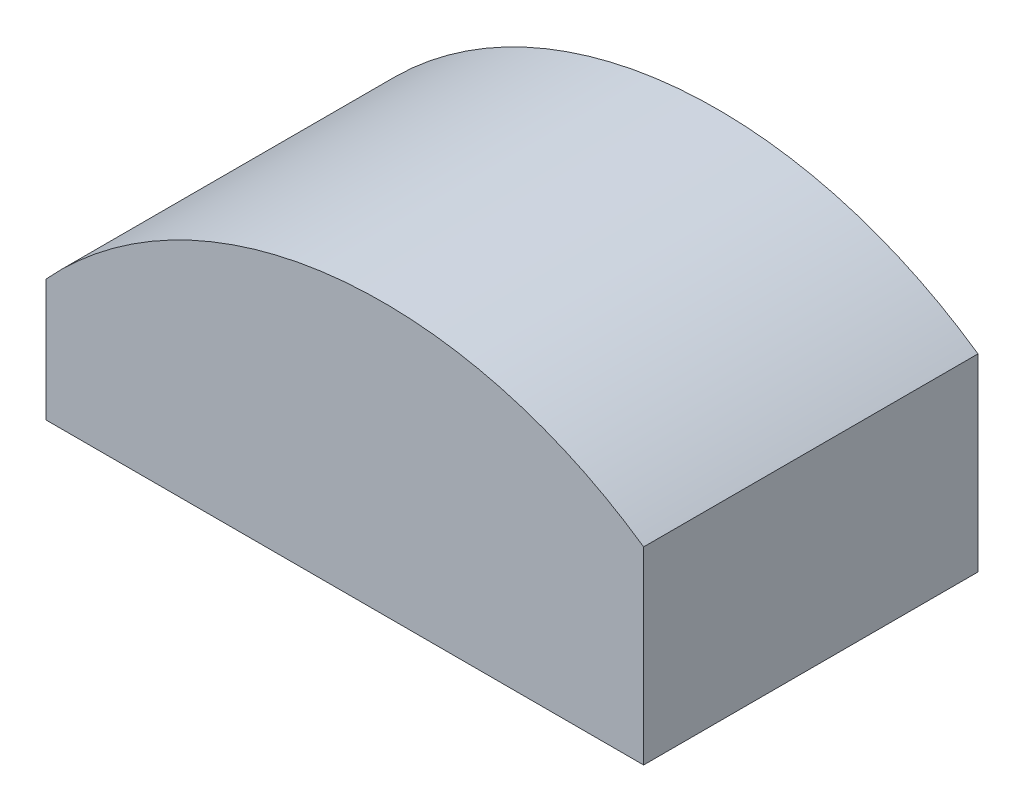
ISO-10303-21;
HEADER;
FILE_DESCRIPTION(('STEP AP214'),'2;1');
FILE_NAME('part.step','',(''),(''),'','','');
FILE_SCHEMA(('AUTOMOTIVE_DESIGN { 1 0 10303 214 1 1 1 1 }'));
ENDSEC;
DATA;
#1=APPLICATION_CONTEXT('core data for automotive mechanical design processes');
#2=APPLICATION_PROTOCOL_DEFINITION('international standard','automotive_design',2000,#1);
#3=PRODUCT_CONTEXT('',#1,'mechanical');
#4=PRODUCT('Part','Part','',(#3));
#5=PRODUCT_RELATED_PRODUCT_CATEGORY('part','',(#4));
#6=PRODUCT_DEFINITION_FORMATION('','',#4);
#7=PRODUCT_DEFINITION_CONTEXT('part definition',#1,'design');
#8=PRODUCT_DEFINITION('design','',#6,#7);
#9=PRODUCT_DEFINITION_SHAPE('','',#8);
#10=(LENGTH_UNIT() NAMED_UNIT(*) SI_UNIT(.MILLI.,.METRE.));
#11=(NAMED_UNIT(*) PLANE_ANGLE_UNIT() SI_UNIT($,.RADIAN.));
#12=(NAMED_UNIT(*) SI_UNIT($,.STERADIAN.) SOLID_ANGLE_UNIT());
#13=UNCERTAINTY_MEASURE_WITH_UNIT(LENGTH_MEASURE(1.E-05),#10,'distance_accuracy_value','');
#14=(GEOMETRIC_REPRESENTATION_CONTEXT(3) GLOBAL_UNCERTAINTY_ASSIGNED_CONTEXT((#13)) GLOBAL_UNIT_ASSIGNED_CONTEXT((#10,
#11,#12)) REPRESENTATION_CONTEXT('',''));
#15=CARTESIAN_POINT('',(0.,0.,0.));
#16=DIRECTION('',(0.,0.,1.));
#17=DIRECTION('',(1.,0.,0.));
#18=AXIS2_PLACEMENT_3D('',#15,#16,#17);
#19=CARTESIAN_POINT('',(0.,0.,61.));
#20=DIRECTION('',(1.,0.,0.));
#21=DIRECTION('',(0.,0.,-1.));
#22=AXIS2_PLACEMENT_3D('',#19,#20,#21);
#23=PLANE('',#22);
#24=DIRECTION('',(0.,-1.,0.));
#25=VECTOR('',#24,1.);
#26=CARTESIAN_POINT('',(0.,0.,61.));
#27=LINE('',#26,#25);
#28=CARTESIAN_POINT('',(0.,22.2637002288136,61.));
#29=VERTEX_POINT('',#28);
#30=CARTESIAN_POINT('',(0.,0.,61.));
#31=VERTEX_POINT('',#30);
#32=EDGE_CURVE('E99',#29,#31,#27,.T.);
#33=ORIENTED_EDGE('',*,*,#32,.F.);
#34=DIRECTION('',(0.,0.,1.));
#35=VECTOR('',#34,1.);
#36=CARTESIAN_POINT('',(0.,22.2637002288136,61.));
#37=LINE('',#36,#35);
#38=CARTESIAN_POINT('',(0.,22.2637002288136,0.));
#39=VERTEX_POINT('',#38);
#40=EDGE_CURVE('E98',#29,#39,#37,.F.);
#41=ORIENTED_EDGE('',*,*,#40,.T.);
#42=DIRECTION('',(0.,-1.,0.));
#43=VECTOR('',#42,1.);
#44=CARTESIAN_POINT('',(0.,0.,0.));
#45=LINE('',#44,#43);
#46=CARTESIAN_POINT('',(0.,0.,0.));
#47=VERTEX_POINT('',#46);
#48=EDGE_CURVE('E88',#39,#47,#45,.T.);
#49=ORIENTED_EDGE('',*,*,#48,.T.);
#50=DIRECTION('',(0.,0.,-1.));
#51=VECTOR('',#50,1.);
#52=CARTESIAN_POINT('',(0.,0.,61.));
#53=LINE('',#52,#51);
#54=EDGE_CURVE('E54',#31,#47,#53,.T.);
#55=ORIENTED_EDGE('',*,*,#54,.F.);
#56=EDGE_LOOP('',(#33,#41,#49,#55));
#57=FACE_BOUND('',#56,.T.);
#58=ADVANCED_FACE('F47',(#57),#23,.F.);
#59=CARTESIAN_POINT('',(0.,0.,61.));
#60=DIRECTION('',(0.,1.,0.));
#61=DIRECTION('',(0.,0.,1.));
#62=AXIS2_PLACEMENT_3D('',#59,#60,#61);
#63=PLANE('',#62);
#64=DIRECTION('',(1.,0.,0.));
#65=VECTOR('',#64,1.);
#66=CARTESIAN_POINT('',(0.,0.,0.));
#67=LINE('',#66,#65);
#68=CARTESIAN_POINT('',(109.029585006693,0.,0.));
#69=VERTEX_POINT('',#68);
#70=EDGE_CURVE('E92',#47,#69,#67,.T.);
#71=ORIENTED_EDGE('',*,*,#70,.T.);
#72=DIRECTION('',(0.,0.,-1.));
#73=VECTOR('',#72,1.);
#74=CARTESIAN_POINT('',(109.029585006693,0.,61.));
#75=LINE('',#74,#73);
#76=CARTESIAN_POINT('',(109.029585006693,0.,61.));
#77=VERTEX_POINT('',#76);
#78=EDGE_CURVE('E114',#77,#69,#75,.T.);
#79=ORIENTED_EDGE('',*,*,#78,.F.);
#80=DIRECTION('',(1.,0.,0.));
#81=VECTOR('',#80,1.);
#82=CARTESIAN_POINT('',(0.,0.,61.));
#83=LINE('',#82,#81);
#84=EDGE_CURVE('E110',#31,#77,#83,.T.);
#85=ORIENTED_EDGE('',*,*,#84,.F.);
#86=ORIENTED_EDGE('',*,*,#54,.T.);
#87=EDGE_LOOP('',(#71,#79,#85,#86));
#88=FACE_BOUND('',#87,.T.);
#89=ADVANCED_FACE('F118',(#88),#63,.F.);
#90=CARTESIAN_POINT('',(109.029585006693,0.,61.));
#91=DIRECTION('',(-1.,0.,0.));
#92=DIRECTION('',(0.,0.,1.));
#93=AXIS2_PLACEMENT_3D('',#90,#91,#92);
#94=PLANE('',#93);
#95=DIRECTION('',(0.,1.,0.));
#96=VECTOR('',#95,1.);
#97=CARTESIAN_POINT('',(109.029585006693,0.,0.));
#98=LINE('',#97,#96);
#99=CARTESIAN_POINT('',(109.029585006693,34.4622318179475,0.));
#100=VERTEX_POINT('',#99);
#101=EDGE_CURVE('E107',#69,#100,#98,.T.);
#102=ORIENTED_EDGE('',*,*,#101,.T.);
#103=DIRECTION('',(0.,0.,1.));
#104=VECTOR('',#103,1.);
#105=CARTESIAN_POINT('',(109.029585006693,34.4622318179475,61.));
#106=LINE('',#105,#104);
#107=CARTESIAN_POINT('',(109.029585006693,34.4622318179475,61.));
#108=VERTEX_POINT('',#107);
#109=EDGE_CURVE('E61',#100,#108,#106,.T.);
#110=ORIENTED_EDGE('',*,*,#109,.T.);
#111=DIRECTION('',(0.,1.,0.));
#112=VECTOR('',#111,1.);
#113=CARTESIAN_POINT('',(109.029585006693,0.,61.));
#114=LINE('',#113,#112);
#115=EDGE_CURVE('E112',#77,#108,#114,.T.);
#116=ORIENTED_EDGE('',*,*,#115,.F.);
#117=ORIENTED_EDGE('',*,*,#78,.T.);
#118=EDGE_LOOP('',(#102,#110,#116,#117));
#119=FACE_BOUND('',#118,.T.);
#120=ADVANCED_FACE('F121',(#119),#94,.F.);
#121=CARTESIAN_POINT('',(0.,51.4290495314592,61.));
#122=DIRECTION('',(0.,0.,-1.));
#123=DIRECTION('',(-1.,0.,0.));
#124=AXIS2_PLACEMENT_3D('',#121,#122,#123);
#125=PLANE('',#124);
#126=ORIENTED_EDGE('',*,*,#115,.T.);
#127=CARTESIAN_POINT('',(61.4882748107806,-33.9655098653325,61.));
#128=DIRECTION('',(0.,0.,-1.));
#129=DIRECTION('',(-1.,0.,0.));
#130=AXIS2_PLACEMENT_3D('',#127,#128,#129);
#131=CIRCLE('',#130,83.321857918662);
#132=EDGE_CURVE('E68',#108,#29,#131,.F.);
#133=ORIENTED_EDGE('',*,*,#132,.T.);
#134=ORIENTED_EDGE('',*,*,#32,.T.);
#135=ORIENTED_EDGE('',*,*,#84,.T.);
#136=EDGE_LOOP('',(#126,#133,#134,#135));
#137=FACE_BOUND('',#136,.T.);
#138=ADVANCED_FACE('F120',(#137),#125,.F.);
#139=CARTESIAN_POINT('',(0.,51.4290495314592,0.));
#140=DIRECTION('',(0.,0.,-1.));
#141=DIRECTION('',(-1.,0.,0.));
#142=AXIS2_PLACEMENT_3D('',#139,#140,#141);
#143=PLANE('',#142);
#144=CARTESIAN_POINT('',(61.4882748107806,-33.9655098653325,0.));
#145=DIRECTION('',(0.,0.,-1.));
#146=DIRECTION('',(-1.,0.,0.));
#147=AXIS2_PLACEMENT_3D('',#144,#145,#146);
#148=CIRCLE('',#147,83.321857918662);
#149=EDGE_CURVE('E12',#100,#39,#148,.F.);
#150=ORIENTED_EDGE('',*,*,#149,.F.);
#151=ORIENTED_EDGE('',*,*,#101,.F.);
#152=ORIENTED_EDGE('',*,*,#70,.F.);
#153=ORIENTED_EDGE('',*,*,#48,.F.);
#154=EDGE_LOOP('',(#150,#151,#152,#153));
#155=FACE_BOUND('',#154,.T.);
#156=ADVANCED_FACE('F90',(#155),#143,.T.);
#157=CARTESIAN_POINT('',(61.4882748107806,-33.9655098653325,61.));
#158=DIRECTION('',(0.,0.,1.));
#159=DIRECTION('',(1.,0.,0.));
#160=AXIS2_PLACEMENT_3D('',#157,#158,#159);
#161=CYLINDRICAL_SURFACE('',#160,83.321857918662);
#162=ORIENTED_EDGE('',*,*,#132,.F.);
#163=ORIENTED_EDGE('',*,*,#109,.F.);
#164=ORIENTED_EDGE('',*,*,#149,.T.);
#165=ORIENTED_EDGE('',*,*,#40,.F.);
#166=EDGE_LOOP('',(#162,#163,#164,#165));
#167=FACE_BOUND('',#166,.T.);
#168=ADVANCED_FACE('F102',(#167),#161,.T.);
#169=CLOSED_SHELL('',(#58,#89,#120,#138,#156,#168));
#170=MANIFOLD_SOLID_BREP('B2',#169);
#171=ADVANCED_BREP_SHAPE_REPRESENTATION('',(#18,#170),#14);
#172=SHAPE_DEFINITION_REPRESENTATION(#9,#171);
ENDSEC;
END-ISO-10303-21;
